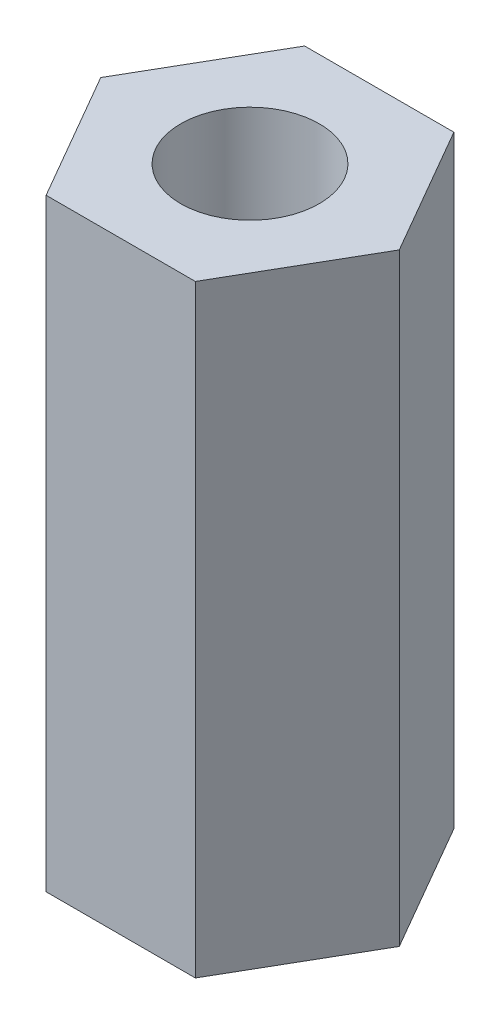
ISO-10303-21;
HEADER;
FILE_DESCRIPTION(('STEP AP214'),'2;1');
FILE_NAME('part.step','',(''),(''),'','','');
FILE_SCHEMA(('AUTOMOTIVE_DESIGN { 1 0 10303 214 1 1 1 1 }'));
ENDSEC;
DATA;
#1=APPLICATION_CONTEXT('core data for automotive mechanical design processes');
#2=APPLICATION_PROTOCOL_DEFINITION('international standard','automotive_design',2000,#1);
#3=PRODUCT_CONTEXT('',#1,'mechanical');
#4=PRODUCT('Part','Part','',(#3));
#5=PRODUCT_RELATED_PRODUCT_CATEGORY('part','',(#4));
#6=PRODUCT_DEFINITION_FORMATION('','',#4);
#7=PRODUCT_DEFINITION_CONTEXT('part definition',#1,'design');
#8=PRODUCT_DEFINITION('design','',#6,#7);
#9=PRODUCT_DEFINITION_SHAPE('','',#8);
#10=(LENGTH_UNIT() NAMED_UNIT(*) SI_UNIT(.MILLI.,.METRE.));
#11=(NAMED_UNIT(*) PLANE_ANGLE_UNIT() SI_UNIT($,.RADIAN.));
#12=(NAMED_UNIT(*) SI_UNIT($,.STERADIAN.) SOLID_ANGLE_UNIT());
#13=UNCERTAINTY_MEASURE_WITH_UNIT(LENGTH_MEASURE(1.E-05),#10,'distance_accuracy_value','');
#14=(GEOMETRIC_REPRESENTATION_CONTEXT(3) GLOBAL_UNCERTAINTY_ASSIGNED_CONTEXT((#13)) GLOBAL_UNIT_ASSIGNED_CONTEXT((#10,
#11,#12)) REPRESENTATION_CONTEXT('',''));
#15=CARTESIAN_POINT('',(0.,0.,0.));
#16=DIRECTION('',(0.,0.,1.));
#17=DIRECTION('',(1.,0.,0.));
#18=AXIS2_PLACEMENT_3D('',#15,#16,#17);
#19=CARTESIAN_POINT('',(-2.74963065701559,11.1125,4.7625));
#20=DIRECTION('',(0.866025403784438,0.,-0.5));
#21=DIRECTION('',(-0.5,0.,-0.866025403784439));
#22=AXIS2_PLACEMENT_3D('',#19,#20,#21);
#23=PLANE('',#22);
#24=DIRECTION('',(0.5,0.,0.866025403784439));
#25=VECTOR('',#24,1.);
#26=CARTESIAN_POINT('',(-2.74963065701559,-11.1125,4.7625));
#27=LINE('',#26,#25);
#28=CARTESIAN_POINT('',(-5.49926131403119,-11.1125,0.));
#29=VERTEX_POINT('',#28);
#30=CARTESIAN_POINT('',(-2.74963065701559,-11.1125,4.7625));
#31=VERTEX_POINT('',#30);
#32=EDGE_CURVE('E118',#29,#31,#27,.T.);
#33=ORIENTED_EDGE('',*,*,#32,.T.);
#34=DIRECTION('',(0.,-1.,0.));
#35=VECTOR('',#34,1.);
#36=CARTESIAN_POINT('',(-2.74963065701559,11.1125,4.7625));
#37=LINE('',#36,#35);
#38=CARTESIAN_POINT('',(-2.74963065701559,11.1125,4.7625));
#39=VERTEX_POINT('',#38);
#40=EDGE_CURVE('E11',#39,#31,#37,.T.);
#41=ORIENTED_EDGE('',*,*,#40,.F.);
#42=DIRECTION('',(0.5,0.,0.866025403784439));
#43=VECTOR('',#42,1.);
#44=CARTESIAN_POINT('',(-2.74963065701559,11.1125,4.7625));
#45=LINE('',#44,#43);
#46=CARTESIAN_POINT('',(-5.49926131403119,11.1125,0.));
#47=VERTEX_POINT('',#46);
#48=EDGE_CURVE('E129',#47,#39,#45,.T.);
#49=ORIENTED_EDGE('',*,*,#48,.F.);
#50=DIRECTION('',(0.,-1.,0.));
#51=VECTOR('',#50,1.);
#52=CARTESIAN_POINT('',(-5.49926131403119,11.1125,0.));
#53=LINE('',#52,#51);
#54=EDGE_CURVE('E114',#47,#29,#53,.T.);
#55=ORIENTED_EDGE('',*,*,#54,.T.);
#56=EDGE_LOOP('',(#33,#41,#49,#55));
#57=FACE_BOUND('',#56,.T.);
#58=ADVANCED_FACE('F34',(#57),#23,.F.);
#59=CARTESIAN_POINT('',(2.74963065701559,11.1125,4.7625));
#60=DIRECTION('',(0.,0.,-1.));
#61=DIRECTION('',(-1.,0.,0.));
#62=AXIS2_PLACEMENT_3D('',#59,#60,#61);
#63=PLANE('',#62);
#64=DIRECTION('',(1.,0.,0.));
#65=VECTOR('',#64,1.);
#66=CARTESIAN_POINT('',(2.74963065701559,-11.1125,4.7625));
#67=LINE('',#66,#65);
#68=CARTESIAN_POINT('',(2.74963065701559,-11.1125,4.7625));
#69=VERTEX_POINT('',#68);
#70=EDGE_CURVE('E121',#31,#69,#67,.T.);
#71=ORIENTED_EDGE('',*,*,#70,.T.);
#72=DIRECTION('',(0.,-1.,0.));
#73=VECTOR('',#72,1.);
#74=CARTESIAN_POINT('',(2.74963065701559,11.1125,4.7625));
#75=LINE('',#74,#73);
#76=CARTESIAN_POINT('',(2.74963065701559,11.1125,4.7625));
#77=VERTEX_POINT('',#76);
#78=EDGE_CURVE('E42',#77,#69,#75,.T.);
#79=ORIENTED_EDGE('',*,*,#78,.F.);
#80=DIRECTION('',(1.,0.,0.));
#81=VECTOR('',#80,1.);
#82=CARTESIAN_POINT('',(2.74963065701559,11.1125,4.7625));
#83=LINE('',#82,#81);
#84=EDGE_CURVE('E87',#39,#77,#83,.T.);
#85=ORIENTED_EDGE('',*,*,#84,.F.);
#86=ORIENTED_EDGE('',*,*,#40,.T.);
#87=EDGE_LOOP('',(#71,#79,#85,#86));
#88=FACE_BOUND('',#87,.T.);
#89=ADVANCED_FACE('F154',(#88),#63,.F.);
#90=CARTESIAN_POINT('',(5.49926131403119,11.1125,0.));
#91=DIRECTION('',(-0.866025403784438,0.,-0.5));
#92=DIRECTION('',(-0.5,0.,0.866025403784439));
#93=AXIS2_PLACEMENT_3D('',#90,#91,#92);
#94=PLANE('',#93);
#95=DIRECTION('',(0.5,0.,-0.866025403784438));
#96=VECTOR('',#95,1.);
#97=CARTESIAN_POINT('',(5.49926131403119,-11.1125,0.));
#98=LINE('',#97,#96);
#99=CARTESIAN_POINT('',(5.49926131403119,-11.1125,0.));
#100=VERTEX_POINT('',#99);
#101=EDGE_CURVE('E124',#69,#100,#98,.T.);
#102=ORIENTED_EDGE('',*,*,#101,.T.);
#103=DIRECTION('',(0.,-1.,0.));
#104=VECTOR('',#103,1.);
#105=CARTESIAN_POINT('',(5.49926131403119,11.1125,0.));
#106=LINE('',#105,#104);
#107=CARTESIAN_POINT('',(5.49926131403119,11.1125,0.));
#108=VERTEX_POINT('',#107);
#109=EDGE_CURVE('E109',#108,#100,#106,.T.);
#110=ORIENTED_EDGE('',*,*,#109,.F.);
#111=DIRECTION('',(0.5,0.,-0.866025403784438));
#112=VECTOR('',#111,1.);
#113=CARTESIAN_POINT('',(5.49926131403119,11.1125,0.));
#114=LINE('',#113,#112);
#115=EDGE_CURVE('E100',#77,#108,#114,.T.);
#116=ORIENTED_EDGE('',*,*,#115,.F.);
#117=ORIENTED_EDGE('',*,*,#78,.T.);
#118=EDGE_LOOP('',(#102,#110,#116,#117));
#119=FACE_BOUND('',#118,.T.);
#120=ADVANCED_FACE('F135',(#119),#94,.F.);
#121=CARTESIAN_POINT('',(2.74963065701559,11.1125,-4.7625));
#122=DIRECTION('',(-0.866025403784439,0.,0.5));
#123=DIRECTION('',(0.5,0.,0.866025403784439));
#124=AXIS2_PLACEMENT_3D('',#121,#122,#123);
#125=PLANE('',#124);
#126=DIRECTION('',(-0.5,0.,-0.866025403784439));
#127=VECTOR('',#126,1.);
#128=CARTESIAN_POINT('',(2.74963065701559,-11.1125,-4.7625));
#129=LINE('',#128,#127);
#130=CARTESIAN_POINT('',(2.74963065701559,-11.1125,-4.7625));
#131=VERTEX_POINT('',#130);
#132=EDGE_CURVE('E108',#100,#131,#129,.T.);
#133=ORIENTED_EDGE('',*,*,#132,.T.);
#134=DIRECTION('',(0.,-1.,0.));
#135=VECTOR('',#134,1.);
#136=CARTESIAN_POINT('',(2.74963065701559,11.1125,-4.7625));
#137=LINE('',#136,#135);
#138=CARTESIAN_POINT('',(2.74963065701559,11.1125,-4.7625));
#139=VERTEX_POINT('',#138);
#140=EDGE_CURVE('E105',#139,#131,#137,.T.);
#141=ORIENTED_EDGE('',*,*,#140,.F.);
#142=DIRECTION('',(-0.5,0.,-0.866025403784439));
#143=VECTOR('',#142,1.);
#144=CARTESIAN_POINT('',(2.74963065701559,11.1125,-4.7625));
#145=LINE('',#144,#143);
#146=EDGE_CURVE('E94',#108,#139,#145,.T.);
#147=ORIENTED_EDGE('',*,*,#146,.F.);
#148=ORIENTED_EDGE('',*,*,#109,.T.);
#149=EDGE_LOOP('',(#133,#141,#147,#148));
#150=FACE_BOUND('',#149,.T.);
#151=ADVANCED_FACE('F106',(#150),#125,.F.);
#152=CARTESIAN_POINT('',(-2.74963065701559,11.1125,-4.7625));
#153=DIRECTION('',(0.,0.,1.));
#154=DIRECTION('',(1.,0.,0.));
#155=AXIS2_PLACEMENT_3D('',#152,#153,#154);
#156=PLANE('',#155);
#157=DIRECTION('',(-1.,0.,0.));
#158=VECTOR('',#157,1.);
#159=CARTESIAN_POINT('',(-2.74963065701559,-11.1125,-4.7625));
#160=LINE('',#159,#158);
#161=CARTESIAN_POINT('',(-2.74963065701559,-11.1125,-4.7625));
#162=VERTEX_POINT('',#161);
#163=EDGE_CURVE('E73',#131,#162,#160,.T.);
#164=ORIENTED_EDGE('',*,*,#163,.T.);
#165=DIRECTION('',(0.,-1.,0.));
#166=VECTOR('',#165,1.);
#167=CARTESIAN_POINT('',(-2.74963065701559,11.1125,-4.7625));
#168=LINE('',#167,#166);
#169=CARTESIAN_POINT('',(-2.74963065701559,11.1125,-4.7625));
#170=VERTEX_POINT('',#169);
#171=EDGE_CURVE('E110',#170,#162,#168,.T.);
#172=ORIENTED_EDGE('',*,*,#171,.F.);
#173=DIRECTION('',(-1.,0.,0.));
#174=VECTOR('',#173,1.);
#175=CARTESIAN_POINT('',(-2.74963065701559,11.1125,-4.7625));
#176=LINE('',#175,#174);
#177=EDGE_CURVE('E98',#139,#170,#176,.T.);
#178=ORIENTED_EDGE('',*,*,#177,.F.);
#179=ORIENTED_EDGE('',*,*,#140,.T.);
#180=EDGE_LOOP('',(#164,#172,#178,#179));
#181=FACE_BOUND('',#180,.T.);
#182=ADVANCED_FACE('F112',(#181),#156,.F.);
#183=CARTESIAN_POINT('',(-5.49926131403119,11.1125,0.));
#184=DIRECTION('',(0.866025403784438,0.,0.5));
#185=DIRECTION('',(0.5,0.,-0.866025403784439));
#186=AXIS2_PLACEMENT_3D('',#183,#184,#185);
#187=PLANE('',#186);
#188=DIRECTION('',(-0.5,0.,0.866025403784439));
#189=VECTOR('',#188,1.);
#190=CARTESIAN_POINT('',(-5.49926131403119,-11.1125,0.));
#191=LINE('',#190,#189);
#192=EDGE_CURVE('E79',#162,#29,#191,.T.);
#193=ORIENTED_EDGE('',*,*,#192,.T.);
#194=ORIENTED_EDGE('',*,*,#54,.F.);
#195=DIRECTION('',(-0.5,0.,0.866025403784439));
#196=VECTOR('',#195,1.);
#197=CARTESIAN_POINT('',(-5.49926131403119,11.1125,0.));
#198=LINE('',#197,#196);
#199=EDGE_CURVE('E50',#170,#47,#198,.T.);
#200=ORIENTED_EDGE('',*,*,#199,.F.);
#201=ORIENTED_EDGE('',*,*,#171,.T.);
#202=EDGE_LOOP('',(#193,#194,#200,#201));
#203=FACE_BOUND('',#202,.T.);
#204=ADVANCED_FACE('F142',(#203),#187,.F.);
#205=CARTESIAN_POINT('',(-5.49926131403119,11.1125,0.));
#206=DIRECTION('',(0.,-1.,0.));
#207=DIRECTION('',(0.,0.,-1.));
#208=AXIS2_PLACEMENT_3D('',#205,#206,#207);
#209=PLANE('',#208);
#210=CARTESIAN_POINT('',(0.,11.1125,0.));
#211=DIRECTION('',(0.,1.,0.));
#212=DIRECTION('',(0.,0.,1.));
#213=AXIS2_PLACEMENT_3D('',#210,#211,#212);
#214=CIRCLE('',#213,2.55269999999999);
#215=CARTESIAN_POINT('',(0.,11.1125,2.55269999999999));
#216=VERTEX_POINT('',#215);
#217=EDGE_CURVE('E211',#216,#216,#214,.T.);
#218=ORIENTED_EDGE('',*,*,#217,.F.);
#219=EDGE_LOOP('',(#218));
#220=FACE_BOUND('',#219,.T.);
#221=ORIENTED_EDGE('',*,*,#48,.T.);
#222=ORIENTED_EDGE('',*,*,#84,.T.);
#223=ORIENTED_EDGE('',*,*,#115,.T.);
#224=ORIENTED_EDGE('',*,*,#146,.T.);
#225=ORIENTED_EDGE('',*,*,#177,.T.);
#226=ORIENTED_EDGE('',*,*,#199,.T.);
#227=EDGE_LOOP('',(#221,#222,#223,#224,#225,#226));
#228=FACE_BOUND('',#227,.T.);
#229=ADVANCED_FACE('F96',(#220,#228),#209,.F.);
#230=CARTESIAN_POINT('',(-5.49926131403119,-11.1125,0.));
#231=DIRECTION('',(0.,-1.,0.));
#232=DIRECTION('',(0.,0.,-1.));
#233=AXIS2_PLACEMENT_3D('',#230,#231,#232);
#234=PLANE('',#233);
#235=CARTESIAN_POINT('',(0.,-11.1125,0.));
#236=DIRECTION('',(0.,1.,0.));
#237=DIRECTION('',(0.,0.,1.));
#238=AXIS2_PLACEMENT_3D('',#235,#236,#237);
#239=CIRCLE('',#238,2.5527);
#240=CARTESIAN_POINT('',(0.,-11.1125,2.5527));
#241=VERTEX_POINT('',#240);
#242=EDGE_CURVE('E122',#241,#241,#239,.T.);
#243=ORIENTED_EDGE('',*,*,#242,.T.);
#244=EDGE_LOOP('',(#243));
#245=FACE_BOUND('',#244,.T.);
#246=ORIENTED_EDGE('',*,*,#32,.F.);
#247=ORIENTED_EDGE('',*,*,#192,.F.);
#248=ORIENTED_EDGE('',*,*,#163,.F.);
#249=ORIENTED_EDGE('',*,*,#132,.F.);
#250=ORIENTED_EDGE('',*,*,#101,.F.);
#251=ORIENTED_EDGE('',*,*,#70,.F.);
#252=EDGE_LOOP('',(#246,#247,#248,#249,#250,#251));
#253=FACE_BOUND('',#252,.T.);
#254=ADVANCED_FACE('F138',(#245,#253),#234,.T.);
#255=CARTESIAN_POINT('',(0.,11.1125,0.));
#256=DIRECTION('',(0.,1.,0.));
#257=DIRECTION('',(0.,0.,1.));
#258=AXIS2_PLACEMENT_3D('',#255,#256,#257);
#259=CYLINDRICAL_SURFACE('',#258,2.55269999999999);
#260=ORIENTED_EDGE('',*,*,#242,.F.);
#261=EDGE_LOOP('',(#260));
#262=FACE_BOUND('',#261,.T.);
#263=ORIENTED_EDGE('',*,*,#217,.T.);
#264=EDGE_LOOP('',(#263));
#265=FACE_BOUND('',#264,.T.);
#266=ADVANCED_FACE('F191',(#262,#265),#259,.F.);
#267=CLOSED_SHELL('',(#58,#89,#120,#151,#182,#204,#229,#254,#266));
#268=MANIFOLD_SOLID_BREP('B2',#267);
#269=ADVANCED_BREP_SHAPE_REPRESENTATION('',(#18,#268),#14);
#270=SHAPE_DEFINITION_REPRESENTATION(#9,#269);
ENDSEC;
END-ISO-10303-21;
